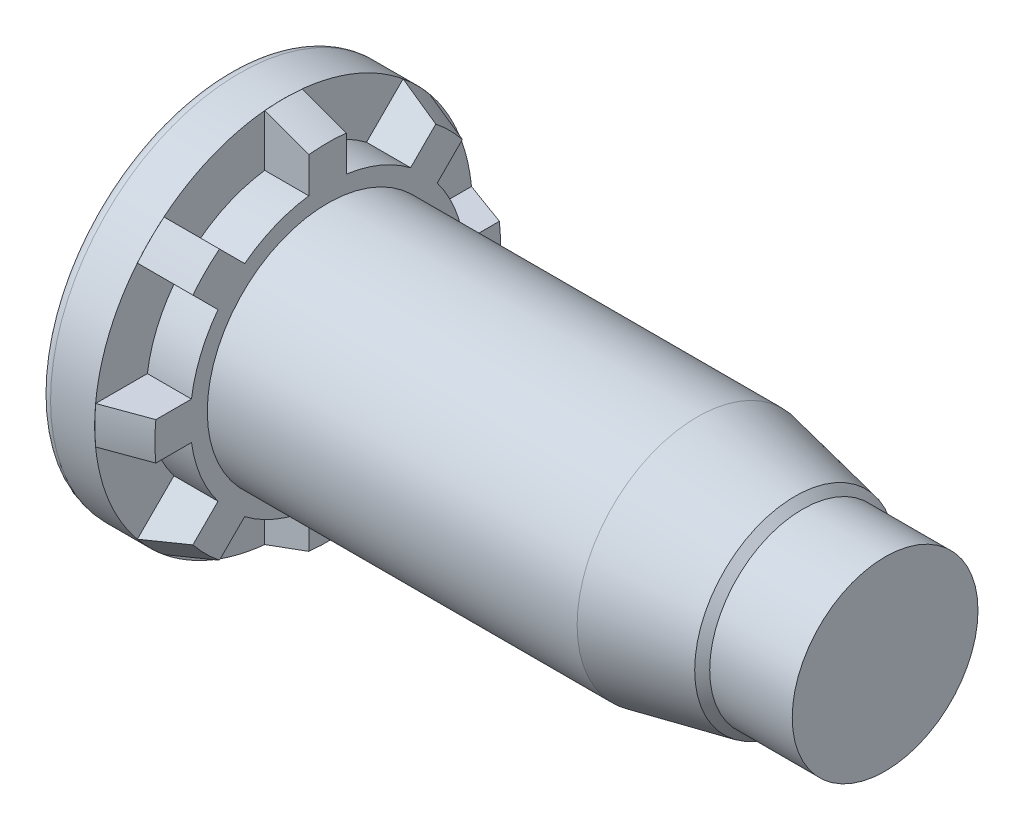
from build123d import *

# Parameters (mm, degrees)
RIBCUT_START     = -1.832
RIBCUT_DEPTH     = 1.832
RIBCUTSPAT_COUNT = 8
RIBCUTSPAT_ANGLE = 315


with BuildPart() as part:
    # BodySke → BaseBody (revolve)
    with BuildSketch(Plane.XY, mode=Mode.PRIVATE) as basebody_sk:
        with BuildLine():
            Line((-2.29, 7.392), (-2.29, 0))
            Line((-2.29, 0), (25, 0))
            Line((25, 0), (25, 3.86))
            Line((25, 3.86), (21.57, 3.86))
            Line((21.57, 3.86), (21.258, 4.172))
            Line((21.258, 4.172), (17.2, 5))
            Line((17.2, 5), (1.832, 5))
            Line((1.832, 5), (1.832, 7.181591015))
            Line((1.832, 7.181591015), (0.00254, 7.84746))
            Line((0.00254, 7.84746), (0, 7.84746))
            Line((0, 7.84746), (0, 7.85))
            Line((0, 7.85), (-1.832, 7.85))
            ThreePointArc((-1.832, 7.85), (-2.155854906, 7.715854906), (-2.29, 7.392))
        make_face()
    revolve(basebody_sk.sketch.rotate(Axis((0, 0, 0), (1, 0, 0)), 90), axis=Axis((0, 0, 0), (1, 0, 0)))

    # RibCutSke → RibCut (cut)
    with BuildSketch(Plane(origin=(1.832, 1.794401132, -0.090952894), x_dir=(0, 0, -1), z_dir=(1, 0, 0)).offset(RIBCUT_START)):
        with BuildLine():
            Line((0.691219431, 3.864296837), (0.691219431, 6.016533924))
            ThreePointArc((0.691219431, 6.016533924), (2.91311205, 5.458053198), (4.879132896, 4.281843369))
            Line((4.879132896, 4.281843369), (3.357271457, 2.759981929))
            ThreePointArc((3.357271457, 2.759981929), (2.095126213, 3.483260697), (0.691219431, 3.864296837))
        make_face()
    ribcut = extrude(amount=RIBCUT_DEPTH, mode=Mode.SUBTRACT)

    # RibCutsPat: RibCut ×8 about axis
    ribcutspat_axis = Axis((0, 0, 0), (1, 0, 0))
    for i in range(1, RIBCUTSPAT_COUNT):
        add(ribcut.rotate(ribcutspat_axis, i * RIBCUTSPAT_ANGLE / (RIBCUTSPAT_COUNT - 1)), mode=Mode.SUBTRACT)


solid = part.part
